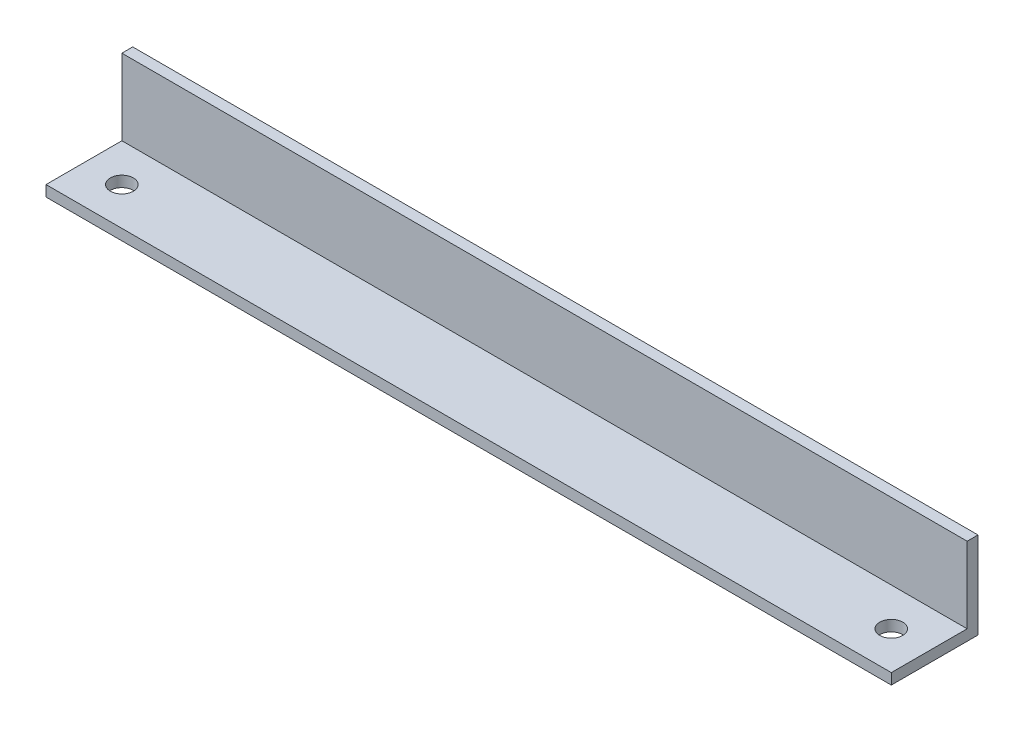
ISO-10303-21;
HEADER;
FILE_DESCRIPTION(('STEP AP214'),'2;1');
FILE_NAME('part.step','',(''),(''),'','','');
FILE_SCHEMA(('AUTOMOTIVE_DESIGN { 1 0 10303 214 1 1 1 1 }'));
ENDSEC;
DATA;
#1=APPLICATION_CONTEXT('core data for automotive mechanical design processes');
#2=APPLICATION_PROTOCOL_DEFINITION('international standard','automotive_design',2000,#1);
#3=PRODUCT_CONTEXT('',#1,'mechanical');
#4=PRODUCT('Part','Part','',(#3));
#5=PRODUCT_RELATED_PRODUCT_CATEGORY('part','',(#4));
#6=PRODUCT_DEFINITION_FORMATION('','',#4);
#7=PRODUCT_DEFINITION_CONTEXT('part definition',#1,'design');
#8=PRODUCT_DEFINITION('design','',#6,#7);
#9=PRODUCT_DEFINITION_SHAPE('','',#8);
#10=(LENGTH_UNIT() NAMED_UNIT(*) SI_UNIT(.MILLI.,.METRE.));
#11=(NAMED_UNIT(*) PLANE_ANGLE_UNIT() SI_UNIT($,.RADIAN.));
#12=(NAMED_UNIT(*) SI_UNIT($,.STERADIAN.) SOLID_ANGLE_UNIT());
#13=UNCERTAINTY_MEASURE_WITH_UNIT(LENGTH_MEASURE(1.E-05),#10,'distance_accuracy_value','');
#14=(GEOMETRIC_REPRESENTATION_CONTEXT(3) GLOBAL_UNCERTAINTY_ASSIGNED_CONTEXT((#13)) GLOBAL_UNIT_ASSIGNED_CONTEXT((#10,
#11,#12)) REPRESENTATION_CONTEXT('',''));
#15=CARTESIAN_POINT('',(0.,0.,0.));
#16=DIRECTION('',(0.,0.,1.));
#17=DIRECTION('',(1.,0.,0.));
#18=AXIS2_PLACEMENT_3D('',#15,#16,#17);
#19=CARTESIAN_POINT('',(123.825,3.175,-12.7));
#20=DIRECTION('',(-1.,0.,0.));
#21=DIRECTION('',(0.,0.,1.));
#22=AXIS2_PLACEMENT_3D('',#19,#20,#21);
#23=PLANE('',#22);
#24=DIRECTION('',(0.,0.,-1.));
#25=VECTOR('',#24,1.);
#26=CARTESIAN_POINT('',(123.825,0.,-12.7));
#27=LINE('',#26,#25);
#28=CARTESIAN_POINT('',(123.825,0.,12.7));
#29=VERTEX_POINT('',#28);
#30=CARTESIAN_POINT('',(123.825,0.,-12.7));
#31=VERTEX_POINT('',#30);
#32=EDGE_CURVE('E89',#29,#31,#27,.T.);
#33=ORIENTED_EDGE('',*,*,#32,.T.);
#34=DIRECTION('',(0.,-1.,0.));
#35=VECTOR('',#34,1.);
#36=CARTESIAN_POINT('',(123.825,3.175,-12.7));
#37=LINE('',#36,#35);
#38=CARTESIAN_POINT('',(123.825,25.4,-12.7));
#39=VERTEX_POINT('',#38);
#40=EDGE_CURVE('E11',#39,#31,#37,.T.);
#41=ORIENTED_EDGE('',*,*,#40,.F.);
#42=DIRECTION('',(0.,0.,-1.));
#43=VECTOR('',#42,1.);
#44=CARTESIAN_POINT('',(123.825,25.4,-9.525));
#45=LINE('',#44,#43);
#46=CARTESIAN_POINT('',(123.825,25.4,-9.525));
#47=VERTEX_POINT('',#46);
#48=EDGE_CURVE('E115',#47,#39,#45,.T.);
#49=ORIENTED_EDGE('',*,*,#48,.F.);
#50=DIRECTION('',(0.,-1.,0.));
#51=VECTOR('',#50,1.);
#52=CARTESIAN_POINT('',(123.825,25.4,-9.525));
#53=LINE('',#52,#51);
#54=CARTESIAN_POINT('',(123.825,3.175,-9.525));
#55=VERTEX_POINT('',#54);
#56=EDGE_CURVE('E98',#47,#55,#53,.T.);
#57=ORIENTED_EDGE('',*,*,#56,.T.);
#58=DIRECTION('',(0.,0.,-1.));
#59=VECTOR('',#58,1.);
#60=CARTESIAN_POINT('',(123.825,3.175,-12.7));
#61=LINE('',#60,#59);
#62=CARTESIAN_POINT('',(123.825,3.175,12.7));
#63=VERTEX_POINT('',#62);
#64=EDGE_CURVE('E83',#63,#55,#61,.T.);
#65=ORIENTED_EDGE('',*,*,#64,.F.);
#66=DIRECTION('',(0.,-1.,0.));
#67=VECTOR('',#66,1.);
#68=CARTESIAN_POINT('',(123.825,3.175,12.7));
#69=LINE('',#68,#67);
#70=EDGE_CURVE('E76',#63,#29,#69,.T.);
#71=ORIENTED_EDGE('',*,*,#70,.T.);
#72=EDGE_LOOP('',(#33,#41,#49,#57,#65,#71));
#73=FACE_BOUND('',#72,.T.);
#74=ADVANCED_FACE('F32',(#73),#23,.F.);
#75=CARTESIAN_POINT('',(-123.825,3.175,-12.7));
#76=DIRECTION('',(0.,0.,1.));
#77=DIRECTION('',(1.,0.,0.));
#78=AXIS2_PLACEMENT_3D('',#75,#76,#77);
#79=PLANE('',#78);
#80=DIRECTION('',(-1.,0.,0.));
#81=VECTOR('',#80,1.);
#82=CARTESIAN_POINT('',(-123.825,0.,-12.7));
#83=LINE('',#82,#81);
#84=CARTESIAN_POINT('',(-123.825,0.,-12.7));
#85=VERTEX_POINT('',#84);
#86=EDGE_CURVE('E93',#31,#85,#83,.T.);
#87=ORIENTED_EDGE('',*,*,#86,.T.);
#88=DIRECTION('',(0.,-1.,0.));
#89=VECTOR('',#88,1.);
#90=CARTESIAN_POINT('',(-123.825,3.175,-12.7));
#91=LINE('',#90,#89);
#92=CARTESIAN_POINT('',(-123.825,25.4,-12.7));
#93=VERTEX_POINT('',#92);
#94=EDGE_CURVE('E40',#93,#85,#91,.T.);
#95=ORIENTED_EDGE('',*,*,#94,.F.);
#96=DIRECTION('',(-1.,0.,0.));
#97=VECTOR('',#96,1.);
#98=CARTESIAN_POINT('',(123.825,25.4,-12.7));
#99=LINE('',#98,#97);
#100=EDGE_CURVE('E118',#39,#93,#99,.T.);
#101=ORIENTED_EDGE('',*,*,#100,.F.);
#102=ORIENTED_EDGE('',*,*,#40,.T.);
#103=EDGE_LOOP('',(#87,#95,#101,#102));
#104=FACE_BOUND('',#103,.T.);
#105=ADVANCED_FACE('F176',(#104),#79,.F.);
#106=CARTESIAN_POINT('',(-123.825,3.175,-12.7));
#107=DIRECTION('',(1.,0.,0.));
#108=DIRECTION('',(0.,0.,-1.));
#109=AXIS2_PLACEMENT_3D('',#106,#107,#108);
#110=PLANE('',#109);
#111=DIRECTION('',(0.,0.,1.));
#112=VECTOR('',#111,1.);
#113=CARTESIAN_POINT('',(-123.825,0.,-12.7));
#114=LINE('',#113,#112);
#115=CARTESIAN_POINT('',(-123.825,0.,12.7));
#116=VERTEX_POINT('',#115);
#117=EDGE_CURVE('E84',#85,#116,#114,.T.);
#118=ORIENTED_EDGE('',*,*,#117,.T.);
#119=DIRECTION('',(0.,-1.,0.));
#120=VECTOR('',#119,1.);
#121=CARTESIAN_POINT('',(-123.825,3.175,12.7));
#122=LINE('',#121,#120);
#123=CARTESIAN_POINT('',(-123.825,3.175,12.7));
#124=VERTEX_POINT('',#123);
#125=EDGE_CURVE('E79',#124,#116,#122,.T.);
#126=ORIENTED_EDGE('',*,*,#125,.F.);
#127=DIRECTION('',(0.,0.,1.));
#128=VECTOR('',#127,1.);
#129=CARTESIAN_POINT('',(-123.825,3.175,-12.7));
#130=LINE('',#129,#128);
#131=CARTESIAN_POINT('',(-123.825,3.175,-9.525));
#132=VERTEX_POINT('',#131);
#133=EDGE_CURVE('E108',#132,#124,#130,.T.);
#134=ORIENTED_EDGE('',*,*,#133,.F.);
#135=DIRECTION('',(0.,-1.,0.));
#136=VECTOR('',#135,1.);
#137=CARTESIAN_POINT('',(-123.825,25.4,-9.525));
#138=LINE('',#137,#136);
#139=CARTESIAN_POINT('',(-123.825,25.4,-9.525));
#140=VERTEX_POINT('',#139);
#141=EDGE_CURVE('E94',#140,#132,#138,.T.);
#142=ORIENTED_EDGE('',*,*,#141,.F.);
#143=DIRECTION('',(0.,0.,1.));
#144=VECTOR('',#143,1.);
#145=CARTESIAN_POINT('',(-123.825,25.4,-12.7));
#146=LINE('',#145,#144);
#147=EDGE_CURVE('E131',#93,#140,#146,.T.);
#148=ORIENTED_EDGE('',*,*,#147,.F.);
#149=ORIENTED_EDGE('',*,*,#94,.T.);
#150=EDGE_LOOP('',(#118,#126,#134,#142,#148,#149));
#151=FACE_BOUND('',#150,.T.);
#152=ADVANCED_FACE('F180',(#151),#110,.F.);
#153=CARTESIAN_POINT('',(-123.825,3.175,12.7));
#154=DIRECTION('',(0.,0.,-1.));
#155=DIRECTION('',(-1.,0.,0.));
#156=AXIS2_PLACEMENT_3D('',#153,#154,#155);
#157=PLANE('',#156);
#158=DIRECTION('',(1.,0.,0.));
#159=VECTOR('',#158,1.);
#160=CARTESIAN_POINT('',(-123.825,0.,12.7));
#161=LINE('',#160,#159);
#162=EDGE_CURVE('E73',#116,#29,#161,.T.);
#163=ORIENTED_EDGE('',*,*,#162,.T.);
#164=ORIENTED_EDGE('',*,*,#70,.F.);
#165=DIRECTION('',(1.,0.,0.));
#166=VECTOR('',#165,1.);
#167=CARTESIAN_POINT('',(-123.825,3.175,12.7));
#168=LINE('',#167,#166);
#169=EDGE_CURVE('E54',#124,#63,#168,.T.);
#170=ORIENTED_EDGE('',*,*,#169,.F.);
#171=ORIENTED_EDGE('',*,*,#125,.T.);
#172=EDGE_LOOP('',(#163,#164,#170,#171));
#173=FACE_BOUND('',#172,.T.);
#174=ADVANCED_FACE('F75',(#173),#157,.F.);
#175=CARTESIAN_POINT('',(123.825,3.175,12.7));
#176=DIRECTION('',(0.,1.,0.));
#177=DIRECTION('',(0.,0.,1.));
#178=AXIS2_PLACEMENT_3D('',#175,#176,#177);
#179=PLANE('',#178);
#180=CARTESIAN_POINT('',(112.7125,3.175,1.5875));
#181=DIRECTION('',(0.,1.,0.));
#182=DIRECTION('',(0.,0.,1.));
#183=AXIS2_PLACEMENT_3D('',#180,#181,#182);
#184=CIRCLE('',#183,3.37819999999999);
#185=CARTESIAN_POINT('',(112.7125,3.175,4.96569999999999));
#186=VERTEX_POINT('',#185);
#187=EDGE_CURVE('E144',#186,#186,#184,.T.);
#188=ORIENTED_EDGE('',*,*,#187,.F.);
#189=EDGE_LOOP('',(#188));
#190=FACE_BOUND('',#189,.T.);
#191=CARTESIAN_POINT('',(-112.7125,3.175,1.5875));
#192=DIRECTION('',(0.,1.,0.));
#193=DIRECTION('',(0.,0.,1.));
#194=AXIS2_PLACEMENT_3D('',#191,#192,#193);
#195=CIRCLE('',#194,3.37819999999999);
#196=CARTESIAN_POINT('',(-112.7125,3.175,4.96569999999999));
#197=VERTEX_POINT('',#196);
#198=EDGE_CURVE('E138',#197,#197,#195,.T.);
#199=ORIENTED_EDGE('',*,*,#198,.F.);
#200=EDGE_LOOP('',(#199));
#201=FACE_BOUND('',#200,.T.);
#202=DIRECTION('',(1.,0.,0.));
#203=VECTOR('',#202,1.);
#204=CARTESIAN_POINT('',(-123.825,3.175,-9.525));
#205=LINE('',#204,#203);
#206=EDGE_CURVE('E48',#132,#55,#205,.T.);
#207=ORIENTED_EDGE('',*,*,#206,.F.);
#208=ORIENTED_EDGE('',*,*,#133,.T.);
#209=ORIENTED_EDGE('',*,*,#169,.T.);
#210=ORIENTED_EDGE('',*,*,#64,.T.);
#211=EDGE_LOOP('',(#207,#208,#209,#210));
#212=FACE_BOUND('',#211,.T.);
#213=ADVANCED_FACE('F159',(#190,#201,#212),#179,.T.);
#214=CARTESIAN_POINT('',(123.825,0.,12.7));
#215=DIRECTION('',(0.,1.,0.));
#216=DIRECTION('',(0.,0.,1.));
#217=AXIS2_PLACEMENT_3D('',#214,#215,#216);
#218=PLANE('',#217);
#219=CARTESIAN_POINT('',(112.7125,0.,1.5875));
#220=DIRECTION('',(0.,1.,0.));
#221=DIRECTION('',(0.,0.,1.));
#222=AXIS2_PLACEMENT_3D('',#219,#220,#221);
#223=CIRCLE('',#222,3.37819999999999);
#224=CARTESIAN_POINT('',(112.7125,0.,4.96569999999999));
#225=VERTEX_POINT('',#224);
#226=EDGE_CURVE('E141',#225,#225,#223,.T.);
#227=ORIENTED_EDGE('',*,*,#226,.T.);
#228=EDGE_LOOP('',(#227));
#229=FACE_BOUND('',#228,.T.);
#230=CARTESIAN_POINT('',(-112.7125,0.,1.5875));
#231=DIRECTION('',(0.,1.,0.));
#232=DIRECTION('',(0.,0.,1.));
#233=AXIS2_PLACEMENT_3D('',#230,#231,#232);
#234=CIRCLE('',#233,3.37819999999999);
#235=CARTESIAN_POINT('',(-112.7125,0.,4.96569999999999));
#236=VERTEX_POINT('',#235);
#237=EDGE_CURVE('E119',#236,#236,#234,.T.);
#238=ORIENTED_EDGE('',*,*,#237,.T.);
#239=EDGE_LOOP('',(#238));
#240=FACE_BOUND('',#239,.T.);
#241=ORIENTED_EDGE('',*,*,#32,.F.);
#242=ORIENTED_EDGE('',*,*,#162,.F.);
#243=ORIENTED_EDGE('',*,*,#117,.F.);
#244=ORIENTED_EDGE('',*,*,#86,.F.);
#245=EDGE_LOOP('',(#241,#242,#243,#244));
#246=FACE_BOUND('',#245,.T.);
#247=ADVANCED_FACE('F92',(#229,#240,#246),#218,.F.);
#248=CARTESIAN_POINT('',(-123.825,25.4,-9.525));
#249=DIRECTION('',(0.,0.,-1.));
#250=DIRECTION('',(-1.,0.,0.));
#251=AXIS2_PLACEMENT_3D('',#248,#249,#250);
#252=PLANE('',#251);
#253=ORIENTED_EDGE('',*,*,#206,.T.);
#254=ORIENTED_EDGE('',*,*,#56,.F.);
#255=DIRECTION('',(1.,0.,0.));
#256=VECTOR('',#255,1.);
#257=CARTESIAN_POINT('',(-123.825,25.4,-9.525));
#258=LINE('',#257,#256);
#259=EDGE_CURVE('E126',#140,#47,#258,.T.);
#260=ORIENTED_EDGE('',*,*,#259,.F.);
#261=ORIENTED_EDGE('',*,*,#141,.T.);
#262=EDGE_LOOP('',(#253,#254,#260,#261));
#263=FACE_BOUND('',#262,.T.);
#264=ADVANCED_FACE('F172',(#263),#252,.F.);
#265=CARTESIAN_POINT('',(-123.825,25.4,-12.7));
#266=DIRECTION('',(0.,1.,0.));
#267=DIRECTION('',(0.,0.,1.));
#268=AXIS2_PLACEMENT_3D('',#265,#266,#267);
#269=PLANE('',#268);
#270=ORIENTED_EDGE('',*,*,#100,.T.);
#271=ORIENTED_EDGE('',*,*,#147,.T.);
#272=ORIENTED_EDGE('',*,*,#259,.T.);
#273=ORIENTED_EDGE('',*,*,#48,.T.);
#274=EDGE_LOOP('',(#270,#271,#272,#273));
#275=FACE_BOUND('',#274,.T.);
#276=ADVANCED_FACE('F166',(#275),#269,.T.);
#277=CARTESIAN_POINT('',(-112.7125,0.,1.5875));
#278=DIRECTION('',(0.,1.,0.));
#279=DIRECTION('',(0.,0.,1.));
#280=AXIS2_PLACEMENT_3D('',#277,#278,#279);
#281=CYLINDRICAL_SURFACE('',#280,3.37819999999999);
#282=ORIENTED_EDGE('',*,*,#237,.F.);
#283=EDGE_LOOP('',(#282));
#284=FACE_BOUND('',#283,.T.);
#285=ORIENTED_EDGE('',*,*,#198,.T.);
#286=EDGE_LOOP('',(#285));
#287=FACE_BOUND('',#286,.T.);
#288=ADVANCED_FACE('F155',(#284,#287),#281,.F.);
#289=CARTESIAN_POINT('',(112.7125,0.,1.5875));
#290=DIRECTION('',(0.,1.,0.));
#291=DIRECTION('',(0.,0.,1.));
#292=AXIS2_PLACEMENT_3D('',#289,#290,#291);
#293=CYLINDRICAL_SURFACE('',#292,3.37819999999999);
#294=ORIENTED_EDGE('',*,*,#226,.F.);
#295=EDGE_LOOP('',(#294));
#296=FACE_BOUND('',#295,.T.);
#297=ORIENTED_EDGE('',*,*,#187,.T.);
#298=EDGE_LOOP('',(#297));
#299=FACE_BOUND('',#298,.T.);
#300=ADVANCED_FACE('F152',(#296,#299),#293,.F.);
#301=CLOSED_SHELL('',(#74,#105,#152,#174,#213,#247,#264,#276,#288,#300));
#302=MANIFOLD_SOLID_BREP('B2',#301);
#303=ADVANCED_BREP_SHAPE_REPRESENTATION('',(#18,#302),#14);
#304=SHAPE_DEFINITION_REPRESENTATION(#9,#303);
ENDSEC;
END-ISO-10303-21;
